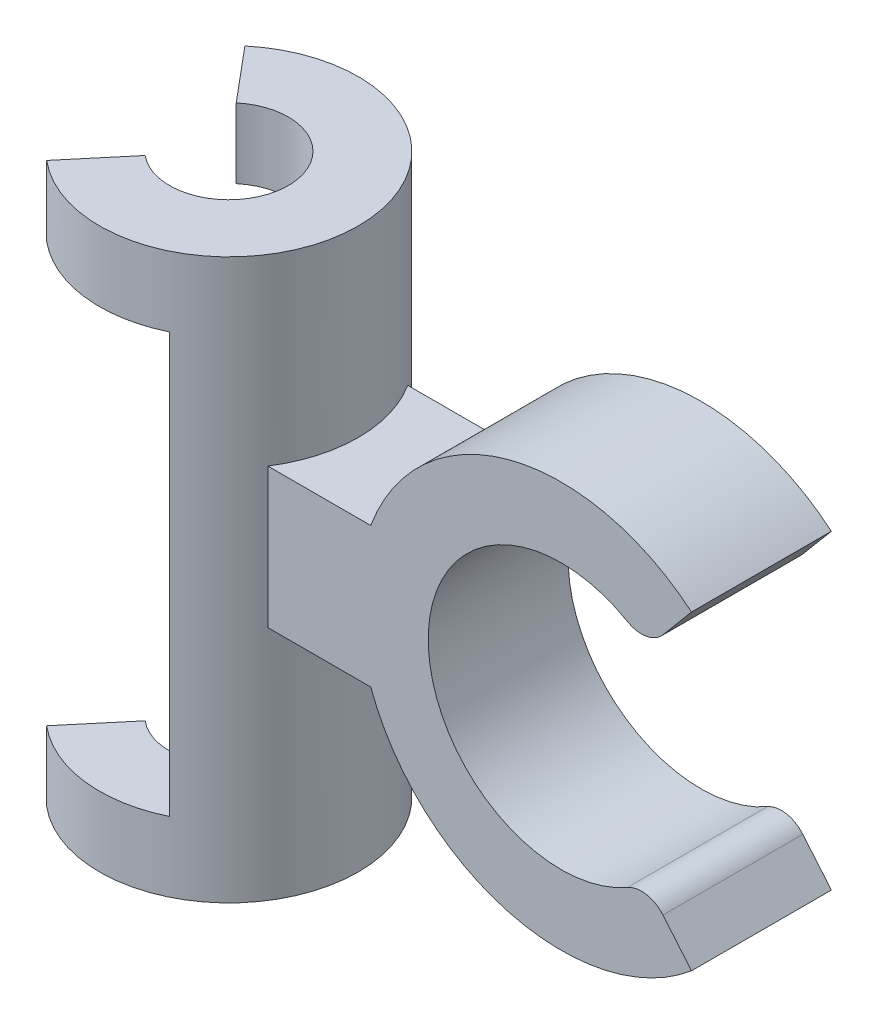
ISO-10303-21;
HEADER;
FILE_DESCRIPTION(('STEP AP214'),'2;1');
FILE_NAME('part.step','',(''),(''),'','','');
FILE_SCHEMA(('AUTOMOTIVE_DESIGN { 1 0 10303 214 1 1 1 1 }'));
ENDSEC;
DATA;
#1=APPLICATION_CONTEXT('core data for automotive mechanical design processes');
#2=APPLICATION_PROTOCOL_DEFINITION('international standard','automotive_design',2000,#1);
#3=PRODUCT_CONTEXT('',#1,'mechanical');
#4=PRODUCT('Part','Part','',(#3));
#5=PRODUCT_RELATED_PRODUCT_CATEGORY('part','',(#4));
#6=PRODUCT_DEFINITION_FORMATION('','',#4);
#7=PRODUCT_DEFINITION_CONTEXT('part definition',#1,'design');
#8=PRODUCT_DEFINITION('design','',#6,#7);
#9=PRODUCT_DEFINITION_SHAPE('','',#8);
#10=(LENGTH_UNIT() NAMED_UNIT(*) SI_UNIT(.MILLI.,.METRE.));
#11=(NAMED_UNIT(*) PLANE_ANGLE_UNIT() SI_UNIT($,.RADIAN.));
#12=(NAMED_UNIT(*) SI_UNIT($,.STERADIAN.) SOLID_ANGLE_UNIT());
#13=UNCERTAINTY_MEASURE_WITH_UNIT(LENGTH_MEASURE(1.E-05),#10,'distance_accuracy_value','');
#14=(GEOMETRIC_REPRESENTATION_CONTEXT(3) GLOBAL_UNCERTAINTY_ASSIGNED_CONTEXT((#13)) GLOBAL_UNIT_ASSIGNED_CONTEXT((#10,
#11,#12)) REPRESENTATION_CONTEXT('',''));
#15=CARTESIAN_POINT('',(0.,0.,0.));
#16=DIRECTION('',(0.,0.,1.));
#17=DIRECTION('',(1.,0.,0.));
#18=AXIS2_PLACEMENT_3D('',#15,#16,#17);
#19=CARTESIAN_POINT('',(0.,0.,0.));
#20=DIRECTION('',(0.,1.,0.));
#21=DIRECTION('',(0.,0.,1.));
#22=AXIS2_PLACEMENT_3D('',#19,#20,#21);
#23=PLANE('',#22);
#24=DIRECTION('',(0.642787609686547,0.,0.766044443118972));
#25=VECTOR('',#24,1.);
#26=CARTESIAN_POINT('',(-2.73184734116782,0.,-3.25568888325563));
#27=LINE('',#26,#25);
#28=CARTESIAN_POINT('',(-5.94578538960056,0.,-7.08591109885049));
#29=VERTEX_POINT('',#28);
#30=CARTESIAN_POINT('',(-2.73184734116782,0.,-3.25568888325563));
#31=VERTEX_POINT('',#30);
#32=EDGE_CURVE('E199',#29,#31,#27,.T.);
#33=ORIENTED_EDGE('',*,*,#32,.T.);
#34=CARTESIAN_POINT('',(0.,0.,0.));
#35=DIRECTION('',(0.,1.,0.));
#36=DIRECTION('',(0.,0.,1.));
#37=AXIS2_PLACEMENT_3D('',#34,#35,#36);
#38=CIRCLE('',#37,4.25);
#39=CARTESIAN_POINT('',(-2.73184734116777,0.,3.25568888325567));
#40=VERTEX_POINT('',#39);
#41=EDGE_CURVE('E308',#31,#40,#38,.F.);
#42=ORIENTED_EDGE('',*,*,#41,.T.);
#43=DIRECTION('',(-0.642787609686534,0.,0.766044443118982));
#44=VECTOR('',#43,1.);
#45=CARTESIAN_POINT('',(-5.94578538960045,0.,7.08591109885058));
#46=LINE('',#45,#44);
#47=CARTESIAN_POINT('',(-5.94578538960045,0.,7.08591109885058));
#48=VERTEX_POINT('',#47);
#49=EDGE_CURVE('E201',#40,#48,#46,.T.);
#50=ORIENTED_EDGE('',*,*,#49,.T.);
#51=CARTESIAN_POINT('',(0.,0.,0.));
#52=DIRECTION('',(0.,1.,0.));
#53=DIRECTION('',(0.,0.,1.));
#54=AXIS2_PLACEMENT_3D('',#51,#52,#53);
#55=CIRCLE('',#54,9.25);
#56=EDGE_CURVE('E189',#48,#29,#55,.T.);
#57=ORIENTED_EDGE('',*,*,#56,.T.);
#58=EDGE_LOOP('',(#33,#42,#50,#57));
#59=FACE_BOUND('',#58,.T.);
#60=ADVANCED_FACE('F38',(#59),#23,.T.);
#61=CARTESIAN_POINT('',(0.,40.,0.));
#62=DIRECTION('',(0.,-1.,0.));
#63=DIRECTION('',(0.,0.,-1.));
#64=AXIS2_PLACEMENT_3D('',#61,#62,#63);
#65=CYLINDRICAL_SURFACE('',#64,4.25);
#66=ORIENTED_EDGE('',*,*,#41,.F.);
#67=DIRECTION('',(0.,-1.,0.));
#68=VECTOR('',#67,1.);
#69=CARTESIAN_POINT('',(-2.73184734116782,40.,-3.25568888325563));
#70=LINE('',#69,#68);
#71=CARTESIAN_POINT('',(-2.73184734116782,-5.,-3.25568888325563));
#72=VERTEX_POINT('',#71);
#73=EDGE_CURVE('E42',#31,#72,#70,.T.);
#74=ORIENTED_EDGE('',*,*,#73,.T.);
#75=CARTESIAN_POINT('',(0.,-5.,0.));
#76=DIRECTION('',(0.,-1.,0.));
#77=DIRECTION('',(1.,0.,0.));
#78=AXIS2_PLACEMENT_3D('',#75,#76,#77);
#79=CIRCLE('',#78,4.25);
#80=CARTESIAN_POINT('',(4.05421461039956,-5.,-1.27508583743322));
#81=VERTEX_POINT('',#80);
#82=EDGE_CURVE('E300',#81,#72,#79,.F.);
#83=ORIENTED_EDGE('',*,*,#82,.F.);
#84=DIRECTION('',(0.,-1.,0.));
#85=VECTOR('',#84,1.);
#86=CARTESIAN_POINT('',(4.05421461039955,40.,-1.27508583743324));
#87=LINE('',#86,#85);
#88=CARTESIAN_POINT('',(4.05421461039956,-35.,-1.2750858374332));
#89=VERTEX_POINT('',#88);
#90=EDGE_CURVE('E270',#89,#81,#87,.F.);
#91=ORIENTED_EDGE('',*,*,#90,.F.);
#92=CARTESIAN_POINT('',(0.,-35.,0.));
#93=DIRECTION('',(0.,1.,0.));
#94=DIRECTION('',(-1.,0.,0.));
#95=AXIS2_PLACEMENT_3D('',#92,#93,#94);
#96=CIRCLE('',#95,4.25);
#97=CARTESIAN_POINT('',(-2.73184734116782,-35.,-3.25568888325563));
#98=VERTEX_POINT('',#97);
#99=EDGE_CURVE('E291',#98,#89,#96,.F.);
#100=ORIENTED_EDGE('',*,*,#99,.F.);
#101=CARTESIAN_POINT('',(-2.73184734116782,-40.,-3.25568888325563));
#102=VERTEX_POINT('',#101);
#103=EDGE_CURVE('E236',#98,#102,#70,.T.);
#104=ORIENTED_EDGE('',*,*,#103,.T.);
#105=CARTESIAN_POINT('',(0.,-40.,0.));
#106=DIRECTION('',(0.,-1.,0.));
#107=DIRECTION('',(0.,0.,1.));
#108=AXIS2_PLACEMENT_3D('',#105,#106,#107);
#109=CIRCLE('',#108,4.25);
#110=CARTESIAN_POINT('',(-2.73184734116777,-40.,3.25568888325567));
#111=VERTEX_POINT('',#110);
#112=EDGE_CURVE('E229',#102,#111,#109,.T.);
#113=ORIENTED_EDGE('',*,*,#112,.T.);
#114=DIRECTION('',(0.,-1.,0.));
#115=VECTOR('',#114,1.);
#116=CARTESIAN_POINT('',(-2.73184734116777,40.,3.25568888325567));
#117=LINE('',#116,#115);
#118=CARTESIAN_POINT('',(-2.73184734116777,-35.,3.25568888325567));
#119=VERTEX_POINT('',#118);
#120=EDGE_CURVE('E210',#119,#111,#117,.T.);
#121=ORIENTED_EDGE('',*,*,#120,.F.);
#122=CARTESIAN_POINT('',(4.05421461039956,-35.,1.2750858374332));
#123=VERTEX_POINT('',#122);
#124=EDGE_CURVE('E288',#123,#119,#96,.F.);
#125=ORIENTED_EDGE('',*,*,#124,.F.);
#126=DIRECTION('',(0.,-1.,0.));
#127=VECTOR('',#126,1.);
#128=CARTESIAN_POINT('',(4.05421461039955,40.,1.27508583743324));
#129=LINE('',#128,#127);
#130=CARTESIAN_POINT('',(4.05421461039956,-5.,1.27508583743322));
#131=VERTEX_POINT('',#130);
#132=EDGE_CURVE('E286',#131,#123,#129,.T.);
#133=ORIENTED_EDGE('',*,*,#132,.F.);
#134=CARTESIAN_POINT('',(-2.73184734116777,-5.,3.25568888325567));
#135=VERTEX_POINT('',#134);
#136=EDGE_CURVE('E299',#135,#131,#79,.F.);
#137=ORIENTED_EDGE('',*,*,#136,.F.);
#138=EDGE_CURVE('E208',#40,#135,#117,.T.);
#139=ORIENTED_EDGE('',*,*,#138,.F.);
#140=EDGE_LOOP('',(#66,#74,#83,#91,#100,#104,#113,#121,#125,#133,#137,#139));
#141=FACE_BOUND('',#140,.T.);
#142=ADVANCED_FACE('F233',(#141),#65,.F.);
#143=CARTESIAN_POINT('',(-5.94578538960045,40.,7.08591109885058));
#144=DIRECTION('',(0.766044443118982,0.,0.642787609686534));
#145=DIRECTION('',(0.642787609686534,0.,-0.766044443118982));
#146=AXIS2_PLACEMENT_3D('',#143,#144,#145);
#147=PLANE('',#146);
#148=ORIENTED_EDGE('',*,*,#49,.F.);
#149=ORIENTED_EDGE('',*,*,#138,.T.);
#150=DIRECTION('',(0.642787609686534,0.,-0.766044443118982));
#151=VECTOR('',#150,1.);
#152=CARTESIAN_POINT('',(-5.94578538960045,-5.,7.08591109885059));
#153=LINE('',#152,#151);
#154=CARTESIAN_POINT('',(-5.94578538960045,-5.,7.08591109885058));
#155=VERTEX_POINT('',#154);
#156=EDGE_CURVE('E295',#155,#135,#153,.T.);
#157=ORIENTED_EDGE('',*,*,#156,.F.);
#158=DIRECTION('',(0.,-1.,0.));
#159=VECTOR('',#158,1.);
#160=CARTESIAN_POINT('',(-5.94578538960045,40.,7.08591109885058));
#161=LINE('',#160,#159);
#162=EDGE_CURVE('E63',#48,#155,#161,.T.);
#163=ORIENTED_EDGE('',*,*,#162,.F.);
#164=EDGE_LOOP('',(#148,#149,#157,#163));
#165=FACE_BOUND('',#164,.T.);
#166=ADVANCED_FACE('F379',(#165),#147,.F.);
#167=CARTESIAN_POINT('',(0.,40.,0.));
#168=DIRECTION('',(0.,-1.,0.));
#169=DIRECTION('',(0.,0.,-1.));
#170=AXIS2_PLACEMENT_3D('',#167,#168,#169);
#171=CYLINDRICAL_SURFACE('',#170,9.25);
#172=CARTESIAN_POINT('',(0.,-23.1,0.));
#173=DIRECTION('',(0.,1.,0.));
#174=DIRECTION('',(-1.,0.,0.));
#175=AXIS2_PLACEMENT_3D('',#172,#173,#174);
#176=CIRCLE('',#175,9.25);
#177=CARTESIAN_POINT('',(7.78219120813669,-23.1,5.));
#178=VERTEX_POINT('',#177);
#179=CARTESIAN_POINT('',(7.78219120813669,-23.1,-5.));
#180=VERTEX_POINT('',#179);
#181=EDGE_CURVE('E341',#178,#180,#176,.T.);
#182=ORIENTED_EDGE('',*,*,#181,.F.);
#183=DIRECTION('',(0.,-1.,0.));
#184=VECTOR('',#183,1.);
#185=CARTESIAN_POINT('',(7.78219120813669,40.,5.));
#186=LINE('',#185,#184);
#187=CARTESIAN_POINT('',(7.78219120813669,-13.1,5.));
#188=VERTEX_POINT('',#187);
#189=EDGE_CURVE('E339',#178,#188,#186,.F.);
#190=ORIENTED_EDGE('',*,*,#189,.T.);
#191=CARTESIAN_POINT('',(0.,-13.1,0.));
#192=DIRECTION('',(0.,1.,0.));
#193=DIRECTION('',(0.,0.,1.));
#194=AXIS2_PLACEMENT_3D('',#191,#192,#193);
#195=CIRCLE('',#194,9.25);
#196=CARTESIAN_POINT('',(7.78219120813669,-13.1,-5.));
#197=VERTEX_POINT('',#196);
#198=EDGE_CURVE('E344',#188,#197,#195,.T.);
#199=ORIENTED_EDGE('',*,*,#198,.T.);
#200=DIRECTION('',(0.,-1.,0.));
#201=VECTOR('',#200,1.);
#202=CARTESIAN_POINT('',(7.78219120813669,40.,-5.));
#203=LINE('',#202,#201);
#204=EDGE_CURVE('E211',#180,#197,#203,.F.);
#205=ORIENTED_EDGE('',*,*,#204,.F.);
#206=EDGE_LOOP('',(#182,#190,#199,#205));
#207=FACE_BOUND('',#206,.T.);
#208=ORIENTED_EDGE('',*,*,#56,.F.);
#209=ORIENTED_EDGE('',*,*,#162,.T.);
#210=CARTESIAN_POINT('',(0.,-5.,0.));
#211=DIRECTION('',(0.,-1.,0.));
#212=DIRECTION('',(1.,0.,0.));
#213=AXIS2_PLACEMENT_3D('',#210,#211,#212);
#214=CIRCLE('',#213,9.25);
#215=CARTESIAN_POINT('',(4.05421461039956,-5.,8.31419532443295));
#216=VERTEX_POINT('',#215);
#217=EDGE_CURVE('E298',#216,#155,#214,.T.);
#218=ORIENTED_EDGE('',*,*,#217,.F.);
#219=DIRECTION('',(0.,-1.,0.));
#220=VECTOR('',#219,1.);
#221=CARTESIAN_POINT('',(4.05421461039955,40.,8.31419532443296));
#222=LINE('',#221,#220);
#223=CARTESIAN_POINT('',(4.05421461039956,-35.,8.31419532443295));
#224=VERTEX_POINT('',#223);
#225=EDGE_CURVE('E333',#224,#216,#222,.F.);
#226=ORIENTED_EDGE('',*,*,#225,.F.);
#227=CARTESIAN_POINT('',(0.,-35.,0.));
#228=DIRECTION('',(0.,1.,0.));
#229=DIRECTION('',(-1.,0.,0.));
#230=AXIS2_PLACEMENT_3D('',#227,#228,#229);
#231=CIRCLE('',#230,9.25);
#232=CARTESIAN_POINT('',(-5.94578538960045,-35.,7.08591109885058));
#233=VERTEX_POINT('',#232);
#234=EDGE_CURVE('E290',#233,#224,#231,.T.);
#235=ORIENTED_EDGE('',*,*,#234,.F.);
#236=CARTESIAN_POINT('',(-5.94578538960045,-40.,7.08591109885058));
#237=VERTEX_POINT('',#236);
#238=EDGE_CURVE('E194',#233,#237,#161,.T.);
#239=ORIENTED_EDGE('',*,*,#238,.T.);
#240=CARTESIAN_POINT('',(0.,-40.,0.));
#241=DIRECTION('',(0.,1.,0.));
#242=DIRECTION('',(0.,0.,1.));
#243=AXIS2_PLACEMENT_3D('',#240,#241,#242);
#244=CIRCLE('',#243,9.25);
#245=CARTESIAN_POINT('',(-5.94578538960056,-40.,-7.08591109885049));
#246=VERTEX_POINT('',#245);
#247=EDGE_CURVE('E231',#237,#246,#244,.T.);
#248=ORIENTED_EDGE('',*,*,#247,.T.);
#249=DIRECTION('',(0.,-1.,0.));
#250=VECTOR('',#249,1.);
#251=CARTESIAN_POINT('',(-5.94578538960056,40.,-7.08591109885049));
#252=LINE('',#251,#250);
#253=CARTESIAN_POINT('',(-5.94578538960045,-35.,-7.08591109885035));
#254=VERTEX_POINT('',#253);
#255=EDGE_CURVE('E193',#254,#246,#252,.T.);
#256=ORIENTED_EDGE('',*,*,#255,.F.);
#257=CARTESIAN_POINT('',(4.05421461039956,-35.,-8.31419532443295));
#258=VERTEX_POINT('',#257);
#259=EDGE_CURVE('E293',#258,#254,#231,.T.);
#260=ORIENTED_EDGE('',*,*,#259,.F.);
#261=DIRECTION('',(0.,-1.,0.));
#262=VECTOR('',#261,1.);
#263=CARTESIAN_POINT('',(4.05421461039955,40.,-8.31419532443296));
#264=LINE('',#263,#262);
#265=CARTESIAN_POINT('',(4.05421461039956,-5.,-8.31419532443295));
#266=VERTEX_POINT('',#265);
#267=EDGE_CURVE('E331',#266,#258,#264,.T.);
#268=ORIENTED_EDGE('',*,*,#267,.F.);
#269=CARTESIAN_POINT('',(-5.94578538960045,-5.,-7.08591109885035));
#270=VERTEX_POINT('',#269);
#271=EDGE_CURVE('E191',#270,#266,#214,.T.);
#272=ORIENTED_EDGE('',*,*,#271,.F.);
#273=EDGE_CURVE('E55',#29,#270,#252,.T.);
#274=ORIENTED_EDGE('',*,*,#273,.F.);
#275=EDGE_LOOP('',(#208,#209,#218,#226,#235,#239,#248,#256,#260,#268,#272,#274));
#276=FACE_BOUND('',#275,.T.);
#277=ADVANCED_FACE('F40',(#207,#276),#171,.T.);
#278=CARTESIAN_POINT('',(-2.73184734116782,40.,-3.25568888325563));
#279=DIRECTION('',(0.766044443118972,0.,-0.642787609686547));
#280=DIRECTION('',(-0.642787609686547,0.,-0.766044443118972));
#281=AXIS2_PLACEMENT_3D('',#278,#279,#280);
#282=PLANE('',#281);
#283=ORIENTED_EDGE('',*,*,#32,.F.);
#284=ORIENTED_EDGE('',*,*,#273,.T.);
#285=DIRECTION('',(-0.642787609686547,0.,-0.766044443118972));
#286=VECTOR('',#285,1.);
#287=CARTESIAN_POINT('',(-2.73184734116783,-5.,-3.25568888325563));
#288=LINE('',#287,#286);
#289=EDGE_CURVE('E337',#72,#270,#288,.T.);
#290=ORIENTED_EDGE('',*,*,#289,.F.);
#291=ORIENTED_EDGE('',*,*,#73,.F.);
#292=EDGE_LOOP('',(#283,#284,#290,#291));
#293=FACE_BOUND('',#292,.T.);
#294=ADVANCED_FACE('F203',(#293),#282,.F.);
#295=DIRECTION('',(-0.642787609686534,0.,0.766044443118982));
#296=VECTOR('',#295,1.);
#297=CARTESIAN_POINT('',(-5.94578538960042,-35.,7.08591109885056));
#298=LINE('',#297,#296);
#299=EDGE_CURVE('E221',#119,#233,#298,.T.);
#300=ORIENTED_EDGE('',*,*,#299,.F.);
#301=ORIENTED_EDGE('',*,*,#120,.T.);
#302=DIRECTION('',(-0.642787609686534,0.,0.766044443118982));
#303=VECTOR('',#302,1.);
#304=CARTESIAN_POINT('',(-5.94578538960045,-40.,7.08591109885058));
#305=LINE('',#304,#303);
#306=EDGE_CURVE('E219',#111,#237,#305,.T.);
#307=ORIENTED_EDGE('',*,*,#306,.T.);
#308=ORIENTED_EDGE('',*,*,#238,.F.);
#309=EDGE_LOOP('',(#300,#301,#307,#308));
#310=FACE_BOUND('',#309,.T.);
#311=ADVANCED_FACE('F217',(#310),#147,.F.);
#312=DIRECTION('',(0.642787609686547,0.,0.766044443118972));
#313=VECTOR('',#312,1.);
#314=CARTESIAN_POINT('',(-2.7318473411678,-35.,-3.2556888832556));
#315=LINE('',#314,#313);
#316=EDGE_CURVE('E335',#254,#98,#315,.T.);
#317=ORIENTED_EDGE('',*,*,#316,.F.);
#318=ORIENTED_EDGE('',*,*,#255,.T.);
#319=DIRECTION('',(0.642787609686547,0.,0.766044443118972));
#320=VECTOR('',#319,1.);
#321=CARTESIAN_POINT('',(-2.73184734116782,-40.,-3.25568888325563));
#322=LINE('',#321,#320);
#323=EDGE_CURVE('E348',#246,#102,#322,.T.);
#324=ORIENTED_EDGE('',*,*,#323,.T.);
#325=ORIENTED_EDGE('',*,*,#103,.F.);
#326=EDGE_LOOP('',(#317,#318,#324,#325));
#327=FACE_BOUND('',#326,.T.);
#328=ADVANCED_FACE('F354',(#327),#282,.F.);
#329=CARTESIAN_POINT('',(0.,-40.,0.));
#330=DIRECTION('',(0.,1.,0.));
#331=DIRECTION('',(0.,0.,1.));
#332=AXIS2_PLACEMENT_3D('',#329,#330,#331);
#333=PLANE('',#332);
#334=ORIENTED_EDGE('',*,*,#112,.F.);
#335=ORIENTED_EDGE('',*,*,#323,.F.);
#336=ORIENTED_EDGE('',*,*,#247,.F.);
#337=ORIENTED_EDGE('',*,*,#306,.F.);
#338=EDGE_LOOP('',(#334,#335,#336,#337));
#339=FACE_BOUND('',#338,.T.);
#340=ADVANCED_FACE('F227',(#339),#333,.F.);
#341=CARTESIAN_POINT('',(0.,0.,5.));
#342=DIRECTION('',(0.,0.,1.));
#343=DIRECTION('',(1.,0.,0.));
#344=AXIS2_PLACEMENT_3D('',#341,#342,#343);
#345=PLANE('',#344);
#346=DIRECTION('',(-0.642787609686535,0.766044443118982,0.));
#347=VECTOR('',#346,1.);
#348=CARTESIAN_POINT('',(7.95868238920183,6.67812745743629,5.));
#349=LINE('',#348,#347);
#350=CARTESIAN_POINT('',(38.0704203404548,-29.2076444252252,5.));
#351=VERTEX_POINT('',#350);
#352=CARTESIAN_POINT('',(36.0294100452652,-26.7752630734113,5.));
#353=VERTEX_POINT('',#352);
#354=EDGE_CURVE('E279',#351,#353,#349,.T.);
#355=ORIENTED_EDGE('',*,*,#354,.T.);
#356=CARTESIAN_POINT('',(34.4973211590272,-28.0608382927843,5.));
#357=DIRECTION('',(0.,0.,1.));
#358=DIRECTION('',(1.,0.,0.));
#359=AXIS2_PLACEMENT_3D('',#356,#357,#358);
#360=CIRCLE('',#359,2.);
#361=CARTESIAN_POINT('',(33.4977870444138,-26.3285185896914,5.));
#362=VERTEX_POINT('',#361);
#363=EDGE_CURVE('E311',#353,#362,#360,.T.);
#364=ORIENTED_EDGE('',*,*,#363,.T.);
#365=CARTESIAN_POINT('',(28.75,-18.1,5.));
#366=DIRECTION('',(0.,0.,1.));
#367=DIRECTION('',(1.,0.,0.));
#368=AXIS2_PLACEMENT_3D('',#365,#366,#367);
#369=CIRCLE('',#368,9.5);
#370=CARTESIAN_POINT('',(33.4977870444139,-9.87148141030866,5.));
#371=VERTEX_POINT('',#370);
#372=EDGE_CURVE('E276',#371,#362,#369,.T.);
#373=ORIENTED_EDGE('',*,*,#372,.F.);
#374=CARTESIAN_POINT('',(34.4973211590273,-8.13916170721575,5.));
#375=DIRECTION('',(0.,0.,1.));
#376=DIRECTION('',(1.,0.,0.));
#377=AXIS2_PLACEMENT_3D('',#374,#375,#376);
#378=CIRCLE('',#377,2.);
#379=CARTESIAN_POINT('',(36.0294100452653,-9.42473692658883,5.));
#380=VERTEX_POINT('',#379);
#381=EDGE_CURVE('E316',#371,#380,#378,.T.);
#382=ORIENTED_EDGE('',*,*,#381,.T.);
#383=DIRECTION('',(-0.642787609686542,-0.766044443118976,0.));
#384=VECTOR('',#383,1.);
#385=CARTESIAN_POINT('',(25.7837027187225,-21.6350954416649,5.));
#386=LINE('',#385,#384);
#387=CARTESIAN_POINT('',(38.0704203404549,-6.99235557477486,5.));
#388=VERTEX_POINT('',#387);
#389=EDGE_CURVE('E273',#388,#380,#386,.T.);
#390=ORIENTED_EDGE('',*,*,#389,.F.);
#391=CARTESIAN_POINT('',(28.75,-18.1,5.));
#392=DIRECTION('',(0.,0.,1.));
#393=DIRECTION('',(1.,0.,0.));
#394=AXIS2_PLACEMENT_3D('',#391,#392,#393);
#395=CIRCLE('',#394,14.5);
#396=CARTESIAN_POINT('',(15.1393424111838,-13.1,5.));
#397=VERTEX_POINT('',#396);
#398=EDGE_CURVE('E272',#388,#397,#395,.T.);
#399=ORIENTED_EDGE('',*,*,#398,.T.);
#400=DIRECTION('',(1.,0.,0.));
#401=VECTOR('',#400,1.);
#402=CARTESIAN_POINT('',(0.,-13.1,5.));
#403=LINE('',#402,#401);
#404=EDGE_CURVE('E252',#188,#397,#403,.T.);
#405=ORIENTED_EDGE('',*,*,#404,.F.);
#406=ORIENTED_EDGE('',*,*,#189,.F.);
#407=DIRECTION('',(1.,0.,0.));
#408=VECTOR('',#407,1.);
#409=CARTESIAN_POINT('',(0.,-23.1,5.));
#410=LINE('',#409,#408);
#411=CARTESIAN_POINT('',(15.1393424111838,-23.1,5.));
#412=VERTEX_POINT('',#411);
#413=EDGE_CURVE('E256',#178,#412,#410,.T.);
#414=ORIENTED_EDGE('',*,*,#413,.T.);
#415=EDGE_CURVE('E282',#412,#351,#395,.T.);
#416=ORIENTED_EDGE('',*,*,#415,.T.);
#417=EDGE_LOOP('',(#355,#364,#373,#382,#390,#399,#405,#406,#414,#416));
#418=FACE_BOUND('',#417,.T.);
#419=ADVANCED_FACE('F555',(#418),#345,.T.);
#420=CARTESIAN_POINT('',(0.,0.,-5.));
#421=DIRECTION('',(0.,0.,1.));
#422=DIRECTION('',(1.,0.,0.));
#423=AXIS2_PLACEMENT_3D('',#420,#421,#422);
#424=PLANE('',#423);
#425=CARTESIAN_POINT('',(28.75,-18.1,-5.));
#426=DIRECTION('',(0.,0.,1.));
#427=DIRECTION('',(1.,0.,0.));
#428=AXIS2_PLACEMENT_3D('',#425,#426,#427);
#429=CIRCLE('',#428,9.5);
#430=CARTESIAN_POINT('',(33.4977870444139,-9.87148141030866,-5.));
#431=VERTEX_POINT('',#430);
#432=CARTESIAN_POINT('',(33.4977870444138,-26.3285185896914,-5.));
#433=VERTEX_POINT('',#432);
#434=EDGE_CURVE('E260',#431,#433,#429,.T.);
#435=ORIENTED_EDGE('',*,*,#434,.T.);
#436=CARTESIAN_POINT('',(34.4973211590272,-28.0608382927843,-5.));
#437=DIRECTION('',(0.,0.,1.));
#438=DIRECTION('',(1.,0.,0.));
#439=AXIS2_PLACEMENT_3D('',#436,#437,#438);
#440=CIRCLE('',#439,2.);
#441=CARTESIAN_POINT('',(36.0294100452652,-26.7752630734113,-5.));
#442=VERTEX_POINT('',#441);
#443=EDGE_CURVE('E322',#433,#442,#440,.F.);
#444=ORIENTED_EDGE('',*,*,#443,.T.);
#445=DIRECTION('',(-0.642787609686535,0.766044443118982,0.));
#446=VECTOR('',#445,1.);
#447=CARTESIAN_POINT('',(7.95868238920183,6.67812745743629,-5.));
#448=LINE('',#447,#446);
#449=CARTESIAN_POINT('',(38.0704203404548,-29.2076444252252,-5.));
#450=VERTEX_POINT('',#449);
#451=EDGE_CURVE('E263',#450,#442,#448,.T.);
#452=ORIENTED_EDGE('',*,*,#451,.F.);
#453=CARTESIAN_POINT('',(28.75,-18.1,-5.));
#454=DIRECTION('',(0.,0.,1.));
#455=DIRECTION('',(1.,0.,0.));
#456=AXIS2_PLACEMENT_3D('',#453,#454,#455);
#457=CIRCLE('',#456,14.5);
#458=CARTESIAN_POINT('',(15.1393424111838,-23.1,-5.));
#459=VERTEX_POINT('',#458);
#460=EDGE_CURVE('E266',#459,#450,#457,.T.);
#461=ORIENTED_EDGE('',*,*,#460,.F.);
#462=DIRECTION('',(1.,0.,0.));
#463=VECTOR('',#462,1.);
#464=CARTESIAN_POINT('',(0.,-23.1,-5.));
#465=LINE('',#464,#463);
#466=EDGE_CURVE('E268',#180,#459,#465,.T.);
#467=ORIENTED_EDGE('',*,*,#466,.F.);
#468=ORIENTED_EDGE('',*,*,#204,.T.);
#469=DIRECTION('',(1.,0.,0.));
#470=VECTOR('',#469,1.);
#471=CARTESIAN_POINT('',(0.,-13.1,-5.));
#472=LINE('',#471,#470);
#473=CARTESIAN_POINT('',(15.1393424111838,-13.1,-5.));
#474=VERTEX_POINT('',#473);
#475=EDGE_CURVE('E253',#197,#474,#472,.T.);
#476=ORIENTED_EDGE('',*,*,#475,.T.);
#477=CARTESIAN_POINT('',(38.0704203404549,-6.99235557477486,-5.));
#478=VERTEX_POINT('',#477);
#479=EDGE_CURVE('E255',#478,#474,#457,.T.);
#480=ORIENTED_EDGE('',*,*,#479,.F.);
#481=DIRECTION('',(-0.642787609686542,-0.766044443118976,0.));
#482=VECTOR('',#481,1.);
#483=CARTESIAN_POINT('',(25.7837027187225,-21.6350954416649,-5.));
#484=LINE('',#483,#482);
#485=CARTESIAN_POINT('',(36.0294100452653,-9.42473692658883,-5.));
#486=VERTEX_POINT('',#485);
#487=EDGE_CURVE('E257',#478,#486,#484,.T.);
#488=ORIENTED_EDGE('',*,*,#487,.T.);
#489=CARTESIAN_POINT('',(34.4973211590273,-8.13916170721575,-5.));
#490=DIRECTION('',(0.,0.,1.));
#491=DIRECTION('',(1.,0.,0.));
#492=AXIS2_PLACEMENT_3D('',#489,#490,#491);
#493=CIRCLE('',#492,2.);
#494=EDGE_CURVE('E324',#486,#431,#493,.F.);
#495=ORIENTED_EDGE('',*,*,#494,.T.);
#496=EDGE_LOOP('',(#435,#444,#452,#461,#467,#468,#476,#480,#488,#495));
#497=FACE_BOUND('',#496,.T.);
#498=ADVANCED_FACE('F545',(#497),#424,.F.);
#499=CARTESIAN_POINT('',(0.,-23.1,5.));
#500=DIRECTION('',(0.,1.,0.));
#501=DIRECTION('',(-1.,0.,0.));
#502=AXIS2_PLACEMENT_3D('',#499,#500,#501);
#503=PLANE('',#502);
#504=ORIENTED_EDGE('',*,*,#413,.F.);
#505=ORIENTED_EDGE('',*,*,#181,.T.);
#506=ORIENTED_EDGE('',*,*,#466,.T.);
#507=DIRECTION('',(0.,0.,-1.));
#508=VECTOR('',#507,1.);
#509=CARTESIAN_POINT('',(15.1393424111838,-23.1,5.));
#510=LINE('',#509,#508);
#511=EDGE_CURVE('E238',#412,#459,#510,.T.);
#512=ORIENTED_EDGE('',*,*,#511,.F.);
#513=EDGE_LOOP('',(#504,#505,#506,#512));
#514=FACE_BOUND('',#513,.T.);
#515=ADVANCED_FACE('F537',(#514),#503,.F.);
#516=CARTESIAN_POINT('',(28.75,-18.1,5.));
#517=DIRECTION('',(0.,0.,-1.));
#518=DIRECTION('',(-1.,0.,0.));
#519=AXIS2_PLACEMENT_3D('',#516,#517,#518);
#520=CYLINDRICAL_SURFACE('',#519,14.5);
#521=ORIENTED_EDGE('',*,*,#460,.T.);
#522=DIRECTION('',(0.,0.,-1.));
#523=VECTOR('',#522,1.);
#524=CARTESIAN_POINT('',(38.0704203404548,-29.2076444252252,5.));
#525=LINE('',#524,#523);
#526=EDGE_CURVE('E241',#351,#450,#525,.T.);
#527=ORIENTED_EDGE('',*,*,#526,.F.);
#528=ORIENTED_EDGE('',*,*,#415,.F.);
#529=ORIENTED_EDGE('',*,*,#511,.T.);
#530=EDGE_LOOP('',(#521,#527,#528,#529));
#531=FACE_BOUND('',#530,.T.);
#532=ADVANCED_FACE('F505',(#531),#520,.T.);
#533=CARTESIAN_POINT('',(7.95868238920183,6.67812745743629,5.));
#534=DIRECTION('',(-0.766044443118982,-0.642787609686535,0.));
#535=DIRECTION('',(0.642787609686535,-0.766044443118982,0.));
#536=AXIS2_PLACEMENT_3D('',#533,#534,#535);
#537=PLANE('',#536);
#538=ORIENTED_EDGE('',*,*,#451,.T.);
#539=DIRECTION('',(0.,0.,1.));
#540=VECTOR('',#539,1.);
#541=CARTESIAN_POINT('',(36.0294100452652,-26.7752630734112,5.));
#542=LINE('',#541,#540);
#543=EDGE_CURVE('E320',#442,#353,#542,.T.);
#544=ORIENTED_EDGE('',*,*,#543,.T.);
#545=ORIENTED_EDGE('',*,*,#354,.F.);
#546=ORIENTED_EDGE('',*,*,#526,.T.);
#547=EDGE_LOOP('',(#538,#544,#545,#546));
#548=FACE_BOUND('',#547,.T.);
#549=ADVANCED_FACE('F520',(#548),#537,.F.);
#550=CARTESIAN_POINT('',(28.75,-18.1,5.));
#551=DIRECTION('',(0.,0.,-1.));
#552=DIRECTION('',(-1.,0.,0.));
#553=AXIS2_PLACEMENT_3D('',#550,#551,#552);
#554=CYLINDRICAL_SURFACE('',#553,9.5);
#555=ORIENTED_EDGE('',*,*,#372,.T.);
#556=DIRECTION('',(0.,0.,-1.));
#557=VECTOR('',#556,1.);
#558=CARTESIAN_POINT('',(33.4977870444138,-26.3285185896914,5.));
#559=LINE('',#558,#557);
#560=EDGE_CURVE('E326',#362,#433,#559,.T.);
#561=ORIENTED_EDGE('',*,*,#560,.T.);
#562=ORIENTED_EDGE('',*,*,#434,.F.);
#563=DIRECTION('',(0.,0.,-1.));
#564=VECTOR('',#563,1.);
#565=CARTESIAN_POINT('',(33.4977870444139,-9.87148141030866,5.));
#566=LINE('',#565,#564);
#567=EDGE_CURVE('E329',#431,#371,#566,.F.);
#568=ORIENTED_EDGE('',*,*,#567,.T.);
#569=EDGE_LOOP('',(#555,#561,#562,#568));
#570=FACE_BOUND('',#569,.T.);
#571=ADVANCED_FACE('F512',(#570),#554,.F.);
#572=CARTESIAN_POINT('',(25.7837027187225,-21.6350954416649,5.));
#573=DIRECTION('',(0.766044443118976,-0.642787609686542,0.));
#574=DIRECTION('',(0.642787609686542,0.766044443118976,0.));
#575=AXIS2_PLACEMENT_3D('',#572,#573,#574);
#576=PLANE('',#575);
#577=ORIENTED_EDGE('',*,*,#389,.T.);
#578=DIRECTION('',(0.,0.,-1.));
#579=VECTOR('',#578,1.);
#580=CARTESIAN_POINT('',(36.0294100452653,-9.42473692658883,5.));
#581=LINE('',#580,#579);
#582=EDGE_CURVE('E309',#380,#486,#581,.T.);
#583=ORIENTED_EDGE('',*,*,#582,.T.);
#584=ORIENTED_EDGE('',*,*,#487,.F.);
#585=DIRECTION('',(0.,0.,-1.));
#586=VECTOR('',#585,1.);
#587=CARTESIAN_POINT('',(38.0704203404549,-6.99235557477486,5.));
#588=LINE('',#587,#586);
#589=EDGE_CURVE('E247',#388,#478,#588,.T.);
#590=ORIENTED_EDGE('',*,*,#589,.F.);
#591=EDGE_LOOP('',(#577,#583,#584,#590));
#592=FACE_BOUND('',#591,.T.);
#593=ADVANCED_FACE('F502',(#592),#576,.T.);
#594=ORIENTED_EDGE('',*,*,#479,.T.);
#595=DIRECTION('',(0.,0.,-1.));
#596=VECTOR('',#595,1.);
#597=CARTESIAN_POINT('',(15.1393424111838,-13.1,5.));
#598=LINE('',#597,#596);
#599=EDGE_CURVE('E249',#397,#474,#598,.T.);
#600=ORIENTED_EDGE('',*,*,#599,.F.);
#601=ORIENTED_EDGE('',*,*,#398,.F.);
#602=ORIENTED_EDGE('',*,*,#589,.T.);
#603=EDGE_LOOP('',(#594,#600,#601,#602));
#604=FACE_BOUND('',#603,.T.);
#605=ADVANCED_FACE('F493',(#604),#520,.T.);
#606=CARTESIAN_POINT('',(0.,-13.1,5.));
#607=DIRECTION('',(0.,1.,0.));
#608=DIRECTION('',(0.,0.,1.));
#609=AXIS2_PLACEMENT_3D('',#606,#607,#608);
#610=PLANE('',#609);
#611=ORIENTED_EDGE('',*,*,#198,.F.);
#612=ORIENTED_EDGE('',*,*,#404,.T.);
#613=ORIENTED_EDGE('',*,*,#599,.T.);
#614=ORIENTED_EDGE('',*,*,#475,.F.);
#615=EDGE_LOOP('',(#611,#612,#613,#614));
#616=FACE_BOUND('',#615,.T.);
#617=ADVANCED_FACE('F486',(#616),#610,.T.);
#618=CARTESIAN_POINT('',(0.,-5.,-9.25));
#619=DIRECTION('',(0.,-1.,0.));
#620=DIRECTION('',(1.,0.,0.));
#621=AXIS2_PLACEMENT_3D('',#618,#619,#620);
#622=PLANE('',#621);
#623=ORIENTED_EDGE('',*,*,#271,.T.);
#624=DIRECTION('',(0.,0.,1.));
#625=VECTOR('',#624,1.);
#626=CARTESIAN_POINT('',(4.05421461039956,-5.,-9.25));
#627=LINE('',#626,#625);
#628=EDGE_CURVE('E303',#266,#81,#627,.T.);
#629=ORIENTED_EDGE('',*,*,#628,.T.);
#630=ORIENTED_EDGE('',*,*,#82,.T.);
#631=ORIENTED_EDGE('',*,*,#289,.T.);
#632=EDGE_LOOP('',(#623,#629,#630,#631));
#633=FACE_BOUND('',#632,.T.);
#634=ADVANCED_FACE('F359',(#633),#622,.T.);
#635=CARTESIAN_POINT('',(0.,-35.,-9.25));
#636=DIRECTION('',(0.,1.,0.));
#637=DIRECTION('',(-1.,0.,0.));
#638=AXIS2_PLACEMENT_3D('',#635,#636,#637);
#639=PLANE('',#638);
#640=ORIENTED_EDGE('',*,*,#99,.T.);
#641=DIRECTION('',(0.,0.,1.));
#642=VECTOR('',#641,1.);
#643=CARTESIAN_POINT('',(4.05421461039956,-35.,-9.25));
#644=LINE('',#643,#642);
#645=EDGE_CURVE('E47',#258,#89,#644,.T.);
#646=ORIENTED_EDGE('',*,*,#645,.F.);
#647=ORIENTED_EDGE('',*,*,#259,.T.);
#648=ORIENTED_EDGE('',*,*,#316,.T.);
#649=EDGE_LOOP('',(#640,#646,#647,#648));
#650=FACE_BOUND('',#649,.T.);
#651=ADVANCED_FACE('F456',(#650),#639,.T.);
#652=CARTESIAN_POINT('',(4.05421461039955,0.,-9.25));
#653=DIRECTION('',(-1.,0.,0.));
#654=DIRECTION('',(0.,-1.,0.));
#655=AXIS2_PLACEMENT_3D('',#652,#653,#654);
#656=PLANE('',#655);
#657=ORIENTED_EDGE('',*,*,#90,.T.);
#658=ORIENTED_EDGE('',*,*,#628,.F.);
#659=ORIENTED_EDGE('',*,*,#267,.T.);
#660=ORIENTED_EDGE('',*,*,#645,.T.);
#661=EDGE_LOOP('',(#657,#658,#659,#660));
#662=FACE_BOUND('',#661,.T.);
#663=ADVANCED_FACE('F362',(#662),#656,.T.);
#664=ORIENTED_EDGE('',*,*,#132,.T.);
#665=EDGE_CURVE('E11',#123,#224,#644,.T.);
#666=ORIENTED_EDGE('',*,*,#665,.T.);
#667=ORIENTED_EDGE('',*,*,#225,.T.);
#668=EDGE_CURVE('E305',#131,#216,#627,.T.);
#669=ORIENTED_EDGE('',*,*,#668,.F.);
#670=EDGE_LOOP('',(#664,#666,#667,#669));
#671=FACE_BOUND('',#670,.T.);
#672=ADVANCED_FACE('F373',(#671),#656,.T.);
#673=ORIENTED_EDGE('',*,*,#124,.T.);
#674=ORIENTED_EDGE('',*,*,#299,.T.);
#675=ORIENTED_EDGE('',*,*,#234,.T.);
#676=ORIENTED_EDGE('',*,*,#665,.F.);
#677=EDGE_LOOP('',(#673,#674,#675,#676));
#678=FACE_BOUND('',#677,.T.);
#679=ADVANCED_FACE('F377',(#678),#639,.T.);
#680=ORIENTED_EDGE('',*,*,#136,.T.);
#681=ORIENTED_EDGE('',*,*,#668,.T.);
#682=ORIENTED_EDGE('',*,*,#217,.T.);
#683=ORIENTED_EDGE('',*,*,#156,.T.);
#684=EDGE_LOOP('',(#680,#681,#682,#683));
#685=FACE_BOUND('',#684,.T.);
#686=ADVANCED_FACE('F369',(#685),#622,.T.);
#687=CARTESIAN_POINT('',(34.4973211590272,-28.0608382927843,5.));
#688=DIRECTION('',(0.,0.,-1.));
#689=DIRECTION('',(-1.,0.,0.));
#690=AXIS2_PLACEMENT_3D('',#687,#688,#689);
#691=CYLINDRICAL_SURFACE('',#690,2.);
#692=ORIENTED_EDGE('',*,*,#363,.F.);
#693=ORIENTED_EDGE('',*,*,#543,.F.);
#694=ORIENTED_EDGE('',*,*,#443,.F.);
#695=ORIENTED_EDGE('',*,*,#560,.F.);
#696=EDGE_LOOP('',(#692,#693,#694,#695));
#697=FACE_BOUND('',#696,.T.);
#698=ADVANCED_FACE('F431',(#697),#691,.T.);
#699=CARTESIAN_POINT('',(34.4973211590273,-8.13916170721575,5.));
#700=DIRECTION('',(0.,0.,-1.));
#701=DIRECTION('',(-1.,0.,0.));
#702=AXIS2_PLACEMENT_3D('',#699,#700,#701);
#703=CYLINDRICAL_SURFACE('',#702,2.);
#704=ORIENTED_EDGE('',*,*,#381,.F.);
#705=ORIENTED_EDGE('',*,*,#567,.F.);
#706=ORIENTED_EDGE('',*,*,#494,.F.);
#707=ORIENTED_EDGE('',*,*,#582,.F.);
#708=EDGE_LOOP('',(#704,#705,#706,#707));
#709=FACE_BOUND('',#708,.T.);
#710=ADVANCED_FACE('F421',(#709),#703,.T.);
#711=CLOSED_SHELL('',(#60,#142,#166,#277,#294,#311,#328,#340,#419,#498,#515,#532,#549,#571,#593,
#605,#617,#634,#651,#663,#672,#679,#686,#698,#710));
#712=MANIFOLD_SOLID_BREP('B2',#711);
#713=ADVANCED_BREP_SHAPE_REPRESENTATION('',(#18,#712),#14);
#714=SHAPE_DEFINITION_REPRESENTATION(#9,#713);
ENDSEC;
END-ISO-10303-21;
